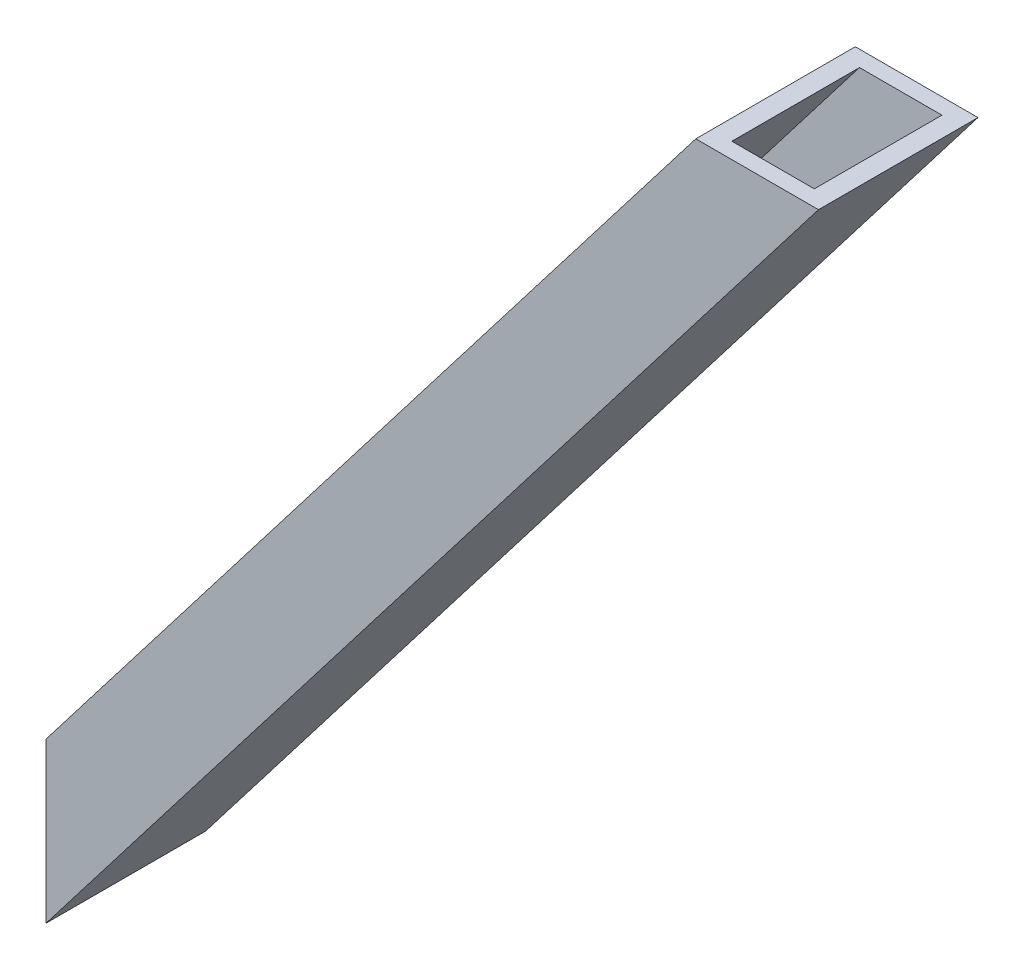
from build123d import *

# Parameters (mm, degrees)
BOSS_EXTRU_1_DEPTH      = 20
COQUE1_T                = -2
ENL_V_MAT_EXTRU_4_DEPTH = 21
ENL_V_MAT_EXTRU_5_DEPTH = 21
ENL_V_MAT_EXTRU_6_DEPTH = 21
ENL_V_MAT_EXTRU_7_DEPTH = 21


with BuildPart() as part:
    # Esquisse2 → Boss.-Extru.1 (new body)
    with BuildSketch(Plane.XY):
        Polygon((0, 0), (0, 20), (100, 150), (100, 130), align=None)
    extrude(amount=BOSS_EXTRU_1_DEPTH)

    # Coque1
    coque1_openings = [part.faces().sort_by_distance(p)[0] for p in [
        (0, 10, 10),
    ]]
    offset(amount=COQUE1_T, openings=coque1_openings, kind=Kind.INTERSECTION)

    # Esquisse6 → Enl_v. mat.-Extru.4 (cut)
    with BuildSketch(Plane.XY.offset(20)):
        Polygon((100, 130), (90.334572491, 137.434944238), (100, 150), align=None)
    extrude(amount=-ENL_V_MAT_EXTRU_4_DEPTH, mode=Mode.SUBTRACT)

    # Esquisse7 → Enl_v. mat.-Extru.5 (cut)
    with BuildSketch(Plane.XY.offset(20)):
        Polygon((100, 130), (86.042005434, 131.854607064), (90.334572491, 137.434944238), align=None)
    extrude(amount=-ENL_V_MAT_EXTRU_5_DEPTH, mode=Mode.SUBTRACT)

    # Esquisse8 → Enl_v. mat.-Extru.6 (cut)
    with BuildSketch(Plane.XY.offset(20)):
        Polygon((100, 130), (81.473950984, 125.91613628), (86.042005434, 131.854607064), align=None)
    extrude(amount=-ENL_V_MAT_EXTRU_6_DEPTH, mode=Mode.SUBTRACT)

    # Esquisse9 → Enl_v. mat.-Extru.7 (cut)
    with BuildSketch(Plane.XY.offset(20)):
        Polygon((81.473950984, 125.91613628), (96.858566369, 125.91613628), (100, 130), align=None)
    extrude(amount=-ENL_V_MAT_EXTRU_7_DEPTH, mode=Mode.SUBTRACT)


solid = part.part
